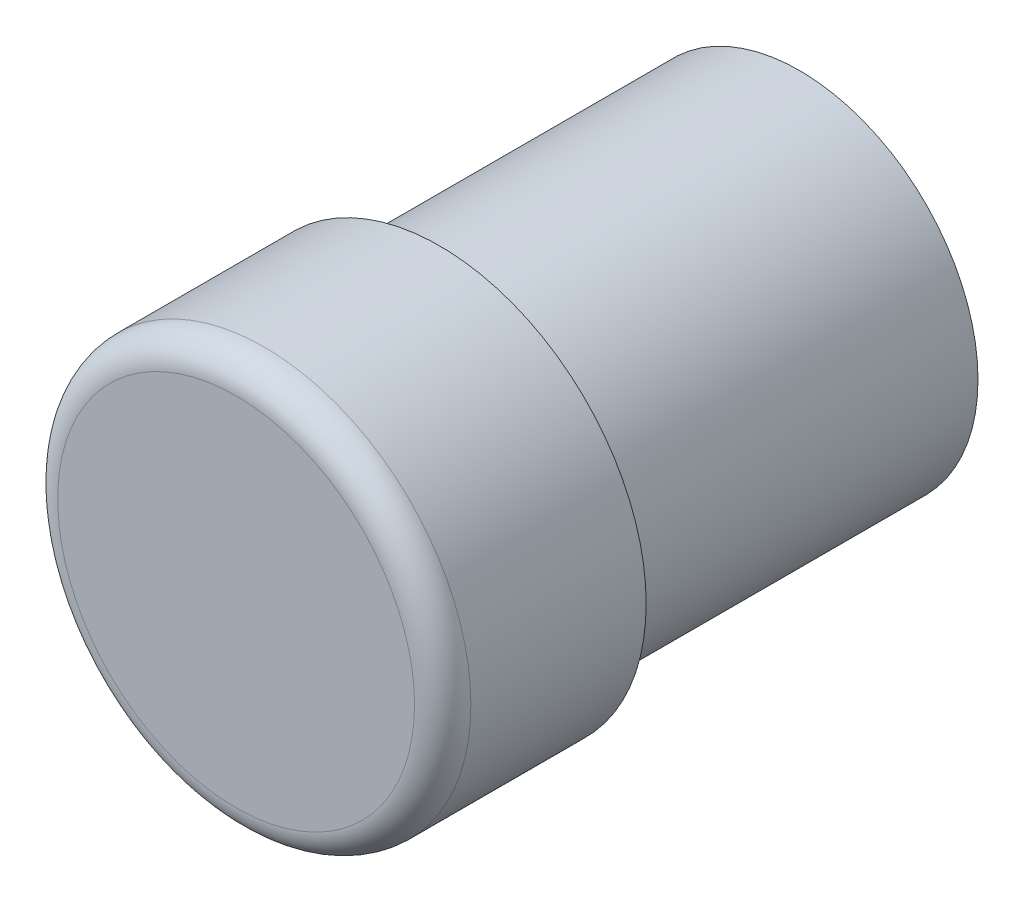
ISO-10303-21;
HEADER;
FILE_DESCRIPTION(('STEP AP214'),'2;1');
FILE_NAME('part.step','',(''),(''),'','','');
FILE_SCHEMA(('AUTOMOTIVE_DESIGN { 1 0 10303 214 1 1 1 1 }'));
ENDSEC;
DATA;
#1=APPLICATION_CONTEXT('core data for automotive mechanical design processes');
#2=APPLICATION_PROTOCOL_DEFINITION('international standard','automotive_design',2000,#1);
#3=PRODUCT_CONTEXT('',#1,'mechanical');
#4=PRODUCT('Part','Part','',(#3));
#5=PRODUCT_RELATED_PRODUCT_CATEGORY('part','',(#4));
#6=PRODUCT_DEFINITION_FORMATION('','',#4);
#7=PRODUCT_DEFINITION_CONTEXT('part definition',#1,'design');
#8=PRODUCT_DEFINITION('design','',#6,#7);
#9=PRODUCT_DEFINITION_SHAPE('','',#8);
#10=(LENGTH_UNIT() NAMED_UNIT(*) SI_UNIT(.MILLI.,.METRE.));
#11=(NAMED_UNIT(*) PLANE_ANGLE_UNIT() SI_UNIT($,.RADIAN.));
#12=(NAMED_UNIT(*) SI_UNIT($,.STERADIAN.) SOLID_ANGLE_UNIT());
#13=UNCERTAINTY_MEASURE_WITH_UNIT(LENGTH_MEASURE(1.E-05),#10,'distance_accuracy_value','');
#14=(GEOMETRIC_REPRESENTATION_CONTEXT(3) GLOBAL_UNCERTAINTY_ASSIGNED_CONTEXT((#13)) GLOBAL_UNIT_ASSIGNED_CONTEXT((#10,
#11,#12)) REPRESENTATION_CONTEXT('',''));
#15=CARTESIAN_POINT('',(0.,0.,0.));
#16=DIRECTION('',(0.,0.,1.));
#17=DIRECTION('',(1.,0.,0.));
#18=AXIS2_PLACEMENT_3D('',#15,#16,#17);
#19=CARTESIAN_POINT('',(0.,0.,13.5));
#20=DIRECTION('',(0.,0.,-1.));
#21=DIRECTION('',(1.,0.,0.));
#22=AXIS2_PLACEMENT_3D('',#19,#20,#21);
#23=TOROIDAL_SURFACE('',#22,9.50000000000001,1.5);
#24=CARTESIAN_POINT('',(0.,0.,13.5));
#25=DIRECTION('',(0.,0.,1.));
#26=DIRECTION('',(1.,0.,0.));
#27=AXIS2_PLACEMENT_3D('',#24,#25,#26);
#28=CIRCLE('',#27,11.);
#29=CARTESIAN_POINT('',(11.,0.,13.5));
#30=VERTEX_POINT('',#29);
#31=EDGE_CURVE('E10',#30,#30,#28,.T.);
#32=ORIENTED_EDGE('',*,*,#31,.T.);
#33=EDGE_LOOP('',(#32));
#34=FACE_BOUND('',#33,.T.);
#35=CARTESIAN_POINT('',(0.,0.,15.));
#36=DIRECTION('',(0.,0.,1.));
#37=DIRECTION('',(1.,0.,0.));
#38=AXIS2_PLACEMENT_3D('',#35,#36,#37);
#39=CIRCLE('',#38,9.49999999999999);
#40=CARTESIAN_POINT('',(9.49999999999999,0.,15.));
#41=VERTEX_POINT('',#40);
#42=EDGE_CURVE('E54',#41,#41,#39,.T.);
#43=ORIENTED_EDGE('',*,*,#42,.F.);
#44=EDGE_LOOP('',(#43));
#45=FACE_BOUND('',#44,.T.);
#46=ADVANCED_FACE('F35',(#34,#45),#23,.T.);
#47=CARTESIAN_POINT('',(0.,0.,-15.));
#48=DIRECTION('',(0.,0.,-1.));
#49=DIRECTION('',(1.,0.,0.));
#50=AXIS2_PLACEMENT_3D('',#47,#48,#49);
#51=CYLINDRICAL_SURFACE('',#50,11.);
#52=CARTESIAN_POINT('',(0.,0.,4.16666666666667));
#53=DIRECTION('',(0.,0.,1.));
#54=DIRECTION('',(1.,0.,0.));
#55=AXIS2_PLACEMENT_3D('',#52,#53,#54);
#56=CIRCLE('',#55,11.);
#57=CARTESIAN_POINT('',(11.,0.,4.16666666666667));
#58=VERTEX_POINT('',#57);
#59=EDGE_CURVE('E41',#58,#58,#56,.T.);
#60=ORIENTED_EDGE('',*,*,#59,.T.);
#61=EDGE_LOOP('',(#60));
#62=FACE_BOUND('',#61,.T.);
#63=ORIENTED_EDGE('',*,*,#31,.F.);
#64=EDGE_LOOP('',(#63));
#65=FACE_BOUND('',#64,.T.);
#66=ADVANCED_FACE('F61',(#62,#65),#51,.T.);
#67=CARTESIAN_POINT('',(0.,11.,4.16666666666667));
#68=DIRECTION('',(0.,0.,1.));
#69=DIRECTION('',(-1.,0.,0.));
#70=AXIS2_PLACEMENT_3D('',#67,#68,#69);
#71=PLANE('',#70);
#72=CARTESIAN_POINT('',(0.,0.,4.16666666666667));
#73=DIRECTION('',(0.,0.,1.));
#74=DIRECTION('',(1.,0.,0.));
#75=AXIS2_PLACEMENT_3D('',#72,#73,#74);
#76=CIRCLE('',#75,9.5);
#77=CARTESIAN_POINT('',(9.5,0.,4.16666666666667));
#78=VERTEX_POINT('',#77);
#79=EDGE_CURVE('E45',#78,#78,#76,.T.);
#80=ORIENTED_EDGE('',*,*,#79,.T.);
#81=EDGE_LOOP('',(#80));
#82=FACE_BOUND('',#81,.T.);
#83=ORIENTED_EDGE('',*,*,#59,.F.);
#84=EDGE_LOOP('',(#83));
#85=FACE_BOUND('',#84,.T.);
#86=ADVANCED_FACE('F65',(#82,#85),#71,.F.);
#87=CARTESIAN_POINT('',(0.,0.,-15.));
#88=DIRECTION('',(0.,0.,-1.));
#89=DIRECTION('',(1.,0.,0.));
#90=AXIS2_PLACEMENT_3D('',#87,#88,#89);
#91=CYLINDRICAL_SURFACE('',#90,9.5);
#92=CARTESIAN_POINT('',(0.,0.,-15.));
#93=DIRECTION('',(0.,0.,1.));
#94=DIRECTION('',(1.,0.,0.));
#95=AXIS2_PLACEMENT_3D('',#92,#93,#94);
#96=CIRCLE('',#95,9.5);
#97=CARTESIAN_POINT('',(9.5,0.,-15.));
#98=VERTEX_POINT('',#97);
#99=EDGE_CURVE('E49',#98,#98,#96,.T.);
#100=ORIENTED_EDGE('',*,*,#99,.T.);
#101=EDGE_LOOP('',(#100));
#102=FACE_BOUND('',#101,.T.);
#103=ORIENTED_EDGE('',*,*,#79,.F.);
#104=EDGE_LOOP('',(#103));
#105=FACE_BOUND('',#104,.T.);
#106=ADVANCED_FACE('F69',(#102,#105),#91,.T.);
#107=CARTESIAN_POINT('',(0.,0.,-15.));
#108=DIRECTION('',(0.,0.,1.));
#109=DIRECTION('',(-1.,0.,0.));
#110=AXIS2_PLACEMENT_3D('',#107,#108,#109);
#111=PLANE('',#110);
#112=ORIENTED_EDGE('',*,*,#99,.F.);
#113=EDGE_LOOP('',(#112));
#114=FACE_BOUND('',#113,.T.);
#115=ADVANCED_FACE('F76',(#114),#111,.F.);
#116=CARTESIAN_POINT('',(0.,0.,15.));
#117=DIRECTION('',(0.,0.,-1.));
#118=DIRECTION('',(1.,0.,0.));
#119=AXIS2_PLACEMENT_3D('',#116,#117,#118);
#120=PLANE('',#119);
#121=ORIENTED_EDGE('',*,*,#42,.T.);
#122=EDGE_LOOP('',(#121));
#123=FACE_BOUND('',#122,.T.);
#124=ADVANCED_FACE('F58',(#123),#120,.F.);
#125=CLOSED_SHELL('',(#46,#66,#86,#106,#115,#124));
#126=MANIFOLD_SOLID_BREP('B2',#125);
#127=ADVANCED_BREP_SHAPE_REPRESENTATION('',(#18,#126),#14);
#128=SHAPE_DEFINITION_REPRESENTATION(#9,#127);
ENDSEC;
END-ISO-10303-21;
